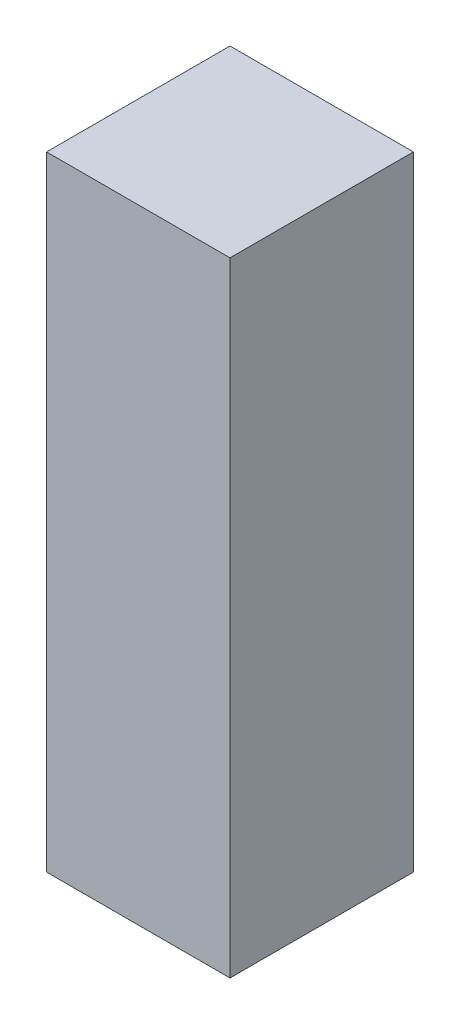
from build123d import *

# Parameters (mm, degrees)
SKETCH1_W           = 0.5
SKETCH1_H           = 0.5
BOSS_EXTRUDE1_DEPTH = 0.85


with BuildPart() as part:
    # Sketch1 → Boss-Extrude1 (new, symmetric)
    with BuildSketch(Plane(origin=(0, 0, 0), x_dir=(1, 0, 0), z_dir=(0, 1, 0))):
        Rectangle(SKETCH1_W, SKETCH1_H)
    extrude(amount=BOSS_EXTRUDE1_DEPTH, both=True)


solid = part.part
